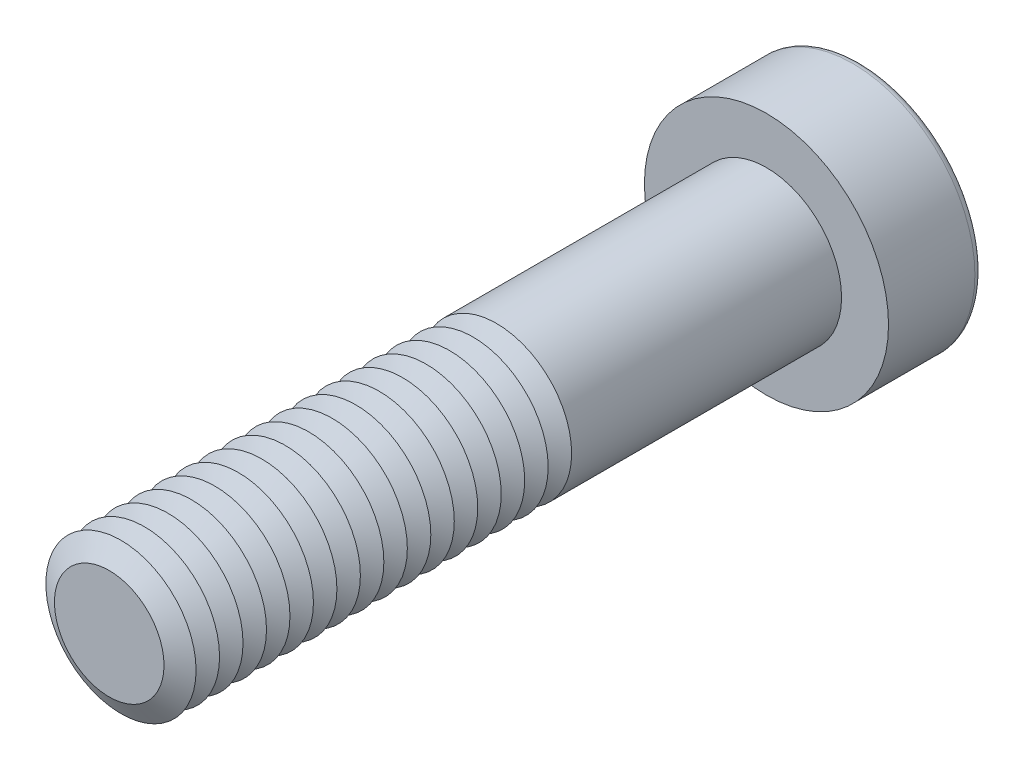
from build123d import *

# Parameters (mm, degrees)
SKETCH1_R           = 4
BOSS_EXTRUDE1_DEPTH = 35
SKETCH2_R           = 6.5
BOSS_EXTRUDE2_DEPTH = 5
CUT_EXTRUDE1_DEPTH  = 3.75
FILLET1_R           = 0.4
LPATTERN1_COUNT     = 17
LPATTERN1_PITCH     = 1.25


with BuildPart() as part:
    # Sketch1 → Boss-Extrude1 (new body)
    with BuildSketch(Plane.XY):
        Circle(SKETCH1_R)
    extrude(amount=BOSS_EXTRUDE1_DEPTH)

    # Sketch2 → Boss-Extrude2 (add)
    with BuildSketch(Plane(origin=(0, 0, 0), x_dir=(-1, 0, 0), z_dir=(0, 0, -1))):
        Circle(SKETCH2_R)
    extrude(amount=BOSS_EXTRUDE2_DEPTH)

    # Sketch3 → Cut-Extrude1 (cut)
    with BuildSketch(Plane(origin=(0, 0, -5), x_dir=(-1, 0, 0), z_dir=(0, 0, -1))):
        Polygon((-1.443375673, 2.5), (-2.886751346, 0), (-1.443375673, -2.5), (1.443375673, -2.5), (2.886751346, 0), (1.443375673, 2.5), align=None)
    extrude(amount=-CUT_EXTRUDE1_DEPTH, mode=Mode.SUBTRACT)

    # Fillet1
    fillet1_edges = [part.edges().sort_by_distance(p)[0] for p in [
        (6.5, 0, -5),
    ]]
    fillet(fillet1_edges, radius=FILLET1_R)

    # Cut-Extrude2 cone 1 section (on through the dimple's axis) → Cut-Extrude2 (revolve, cut)
    with BuildSketch(Plane(origin=(0, 0, -1.25), x_dir=(0, 1, 0), z_dir=(1, 0, 0))):
        Polygon((0, 0), (2.5, 0), (0, 1.443375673), align=None)
    revolve(axis=Axis((0, 0, -1.25), (0, 0, 1)), mode=Mode.SUBTRACT)

    # Cut-Extrude3 cone 1 section (on through the dimple's axis) → Cut-Extrude3 (revolve, cut)
    with BuildSketch(Plane(origin=(0, 0, -5), x_dir=(0, 1, 0), z_dir=(1, 0, 0))):
        Polygon((0, 0), (2.886751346, 0), (0, 0.773502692), align=None)
    revolve(axis=Axis((0, 0, -5), (0, 0, 1)), mode=Mode.SUBTRACT)

    # Sketch7 → Cut-Revolve1 (revolve, cut)
    with BuildSketch(Plane(origin=(0, 0, 0), x_dir=(0, 0, -1), z_dir=(1, 0, 0)), mode=Mode.PRIVATE) as cut_revolve1_sk:
        Polygon((-35, 2.917468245), (-34.375, 4), (-35.625, 4), align=None)
    cut_revolve1 = revolve(cut_revolve1_sk.sketch.rotate(Axis((0, 0, 35), (0, 0, -1)), 90), axis=Axis((0, 0, 35), (0, 0, -1)), mode=Mode.SUBTRACT)

    # LPattern1: Cut-Revolve1 ×17
    with Locations(*[(0, 0, -i * LPATTERN1_PITCH) for i in range(1, LPATTERN1_COUNT)]):
        add(cut_revolve1, mode=Mode.SUBTRACT)


solid = part.part
